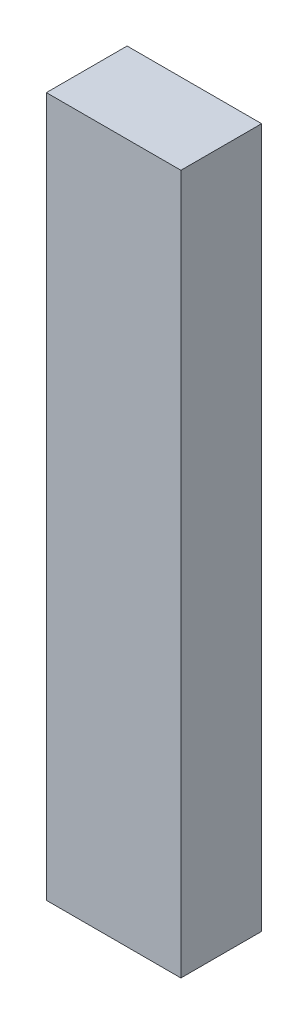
ISO-10303-21;
HEADER;
FILE_DESCRIPTION(('STEP AP214'),'2;1');
FILE_NAME('part.step','',(''),(''),'','','');
FILE_SCHEMA(('AUTOMOTIVE_DESIGN { 1 0 10303 214 1 1 1 1 }'));
ENDSEC;
DATA;
#1=APPLICATION_CONTEXT('core data for automotive mechanical design processes');
#2=APPLICATION_PROTOCOL_DEFINITION('international standard','automotive_design',2000,#1);
#3=PRODUCT_CONTEXT('',#1,'mechanical');
#4=PRODUCT('Part','Part','',(#3));
#5=PRODUCT_RELATED_PRODUCT_CATEGORY('part','',(#4));
#6=PRODUCT_DEFINITION_FORMATION('','',#4);
#7=PRODUCT_DEFINITION_CONTEXT('part definition',#1,'design');
#8=PRODUCT_DEFINITION('design','',#6,#7);
#9=PRODUCT_DEFINITION_SHAPE('','',#8);
#10=(LENGTH_UNIT() NAMED_UNIT(*) SI_UNIT(.MILLI.,.METRE.));
#11=(NAMED_UNIT(*) PLANE_ANGLE_UNIT() SI_UNIT($,.RADIAN.));
#12=(NAMED_UNIT(*) SI_UNIT($,.STERADIAN.) SOLID_ANGLE_UNIT());
#13=UNCERTAINTY_MEASURE_WITH_UNIT(LENGTH_MEASURE(1.E-05),#10,'distance_accuracy_value','');
#14=(GEOMETRIC_REPRESENTATION_CONTEXT(3) GLOBAL_UNCERTAINTY_ASSIGNED_CONTEXT((#13)) GLOBAL_UNIT_ASSIGNED_CONTEXT((#10,
#11,#12)) REPRESENTATION_CONTEXT('',''));
#15=CARTESIAN_POINT('',(0.,0.,0.));
#16=DIRECTION('',(0.,0.,1.));
#17=DIRECTION('',(1.,0.,0.));
#18=AXIS2_PLACEMENT_3D('',#15,#16,#17);
#19=CARTESIAN_POINT('',(63.5000000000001,-165.1,38.1));
#20=DIRECTION('',(0.,1.,0.));
#21=DIRECTION('',(0.,0.,1.));
#22=AXIS2_PLACEMENT_3D('',#19,#20,#21);
#23=PLANE('',#22);
#24=DIRECTION('',(0.,0.,-1.));
#25=VECTOR('',#24,1.);
#26=CARTESIAN_POINT('',(0.,-165.1,38.1));
#27=LINE('',#26,#25);
#28=CARTESIAN_POINT('',(0.,-165.1,38.1));
#29=VERTEX_POINT('',#28);
#30=CARTESIAN_POINT('',(0.,-165.1,0.));
#31=VERTEX_POINT('',#30);
#32=EDGE_CURVE('E115',#29,#31,#27,.T.);
#33=ORIENTED_EDGE('',*,*,#32,.T.);
#34=DIRECTION('',(-1.,0.,0.));
#35=VECTOR('',#34,1.);
#36=CARTESIAN_POINT('',(63.5000000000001,-165.1,0.));
#37=LINE('',#36,#35);
#38=CARTESIAN_POINT('',(63.5000000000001,-165.1,0.));
#39=VERTEX_POINT('',#38);
#40=EDGE_CURVE('E11',#39,#31,#37,.T.);
#41=ORIENTED_EDGE('',*,*,#40,.F.);
#42=DIRECTION('',(0.,0.,-1.));
#43=VECTOR('',#42,1.);
#44=CARTESIAN_POINT('',(63.5000000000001,-165.1,38.1));
#45=LINE('',#44,#43);
#46=CARTESIAN_POINT('',(63.5000000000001,-165.1,38.1));
#47=VERTEX_POINT('',#46);
#48=EDGE_CURVE('E94',#47,#39,#45,.T.);
#49=ORIENTED_EDGE('',*,*,#48,.F.);
#50=DIRECTION('',(-1.,0.,0.));
#51=VECTOR('',#50,1.);
#52=CARTESIAN_POINT('',(63.5000000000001,-165.1,38.1));
#53=LINE('',#52,#51);
#54=EDGE_CURVE('E106',#47,#29,#53,.T.);
#55=ORIENTED_EDGE('',*,*,#54,.T.);
#56=EDGE_LOOP('',(#33,#41,#49,#55));
#57=FACE_BOUND('',#56,.T.);
#58=ADVANCED_FACE('F43',(#57),#23,.F.);
#59=CARTESIAN_POINT('',(63.5000000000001,-165.1,0.));
#60=DIRECTION('',(0.,0.,1.));
#61=DIRECTION('',(1.,0.,0.));
#62=AXIS2_PLACEMENT_3D('',#59,#60,#61);
#63=PLANE('',#62);
#64=DIRECTION('',(0.,1.,0.));
#65=VECTOR('',#64,1.);
#66=CARTESIAN_POINT('',(0.,-165.1,0.));
#67=LINE('',#66,#65);
#68=CARTESIAN_POINT('',(0.,165.1,0.));
#69=VERTEX_POINT('',#68);
#70=EDGE_CURVE('E99',#31,#69,#67,.T.);
#71=ORIENTED_EDGE('',*,*,#70,.T.);
#72=DIRECTION('',(-1.,0.,0.));
#73=VECTOR('',#72,1.);
#74=CARTESIAN_POINT('',(63.5000000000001,165.1,0.));
#75=LINE('',#74,#73);
#76=CARTESIAN_POINT('',(63.5000000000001,165.1,0.));
#77=VERTEX_POINT('',#76);
#78=EDGE_CURVE('E55',#77,#69,#75,.T.);
#79=ORIENTED_EDGE('',*,*,#78,.F.);
#80=DIRECTION('',(0.,1.,0.));
#81=VECTOR('',#80,1.);
#82=CARTESIAN_POINT('',(63.5000000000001,-165.1,0.));
#83=LINE('',#82,#81);
#84=EDGE_CURVE('E89',#39,#77,#83,.T.);
#85=ORIENTED_EDGE('',*,*,#84,.F.);
#86=ORIENTED_EDGE('',*,*,#40,.T.);
#87=EDGE_LOOP('',(#71,#79,#85,#86));
#88=FACE_BOUND('',#87,.T.);
#89=ADVANCED_FACE('F98',(#88),#63,.F.);
#90=CARTESIAN_POINT('',(63.5000000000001,165.1,0.));
#91=DIRECTION('',(0.,-1.,0.));
#92=DIRECTION('',(0.,0.,-1.));
#93=AXIS2_PLACEMENT_3D('',#90,#91,#92);
#94=PLANE('',#93);
#95=DIRECTION('',(0.,0.,1.));
#96=VECTOR('',#95,1.);
#97=CARTESIAN_POINT('',(0.,165.1,0.));
#98=LINE('',#97,#96);
#99=CARTESIAN_POINT('',(0.,165.1,38.1));
#100=VERTEX_POINT('',#99);
#101=EDGE_CURVE('E77',#69,#100,#98,.T.);
#102=ORIENTED_EDGE('',*,*,#101,.T.);
#103=DIRECTION('',(-1.,0.,0.));
#104=VECTOR('',#103,1.);
#105=CARTESIAN_POINT('',(63.5000000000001,165.1,38.1));
#106=LINE('',#105,#104);
#107=CARTESIAN_POINT('',(63.5000000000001,165.1,38.1));
#108=VERTEX_POINT('',#107);
#109=EDGE_CURVE('E105',#108,#100,#106,.T.);
#110=ORIENTED_EDGE('',*,*,#109,.F.);
#111=DIRECTION('',(0.,0.,1.));
#112=VECTOR('',#111,1.);
#113=CARTESIAN_POINT('',(63.5000000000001,165.1,0.));
#114=LINE('',#113,#112);
#115=EDGE_CURVE('E93',#77,#108,#114,.T.);
#116=ORIENTED_EDGE('',*,*,#115,.F.);
#117=ORIENTED_EDGE('',*,*,#78,.T.);
#118=EDGE_LOOP('',(#102,#110,#116,#117));
#119=FACE_BOUND('',#118,.T.);
#120=ADVANCED_FACE('F104',(#119),#94,.F.);
#121=CARTESIAN_POINT('',(63.5000000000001,165.1,38.1));
#122=DIRECTION('',(0.,0.,-1.));
#123=DIRECTION('',(-1.,0.,0.));
#124=AXIS2_PLACEMENT_3D('',#121,#122,#123);
#125=PLANE('',#124);
#126=DIRECTION('',(0.,-1.,0.));
#127=VECTOR('',#126,1.);
#128=CARTESIAN_POINT('',(0.,165.1,38.1));
#129=LINE('',#128,#127);
#130=EDGE_CURVE('E81',#100,#29,#129,.T.);
#131=ORIENTED_EDGE('',*,*,#130,.T.);
#132=ORIENTED_EDGE('',*,*,#54,.F.);
#133=DIRECTION('',(0.,-1.,0.));
#134=VECTOR('',#133,1.);
#135=CARTESIAN_POINT('',(63.5000000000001,165.1,38.1));
#136=LINE('',#135,#134);
#137=EDGE_CURVE('E58',#108,#47,#136,.T.);
#138=ORIENTED_EDGE('',*,*,#137,.F.);
#139=ORIENTED_EDGE('',*,*,#109,.T.);
#140=EDGE_LOOP('',(#131,#132,#138,#139));
#141=FACE_BOUND('',#140,.T.);
#142=ADVANCED_FACE('F128',(#141),#125,.F.);
#143=CARTESIAN_POINT('',(63.5000000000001,0.,0.));
#144=DIRECTION('',(1.,0.,0.));
#145=DIRECTION('',(0.,0.,-1.));
#146=AXIS2_PLACEMENT_3D('',#143,#144,#145);
#147=PLANE('',#146);
#148=ORIENTED_EDGE('',*,*,#48,.T.);
#149=ORIENTED_EDGE('',*,*,#84,.T.);
#150=ORIENTED_EDGE('',*,*,#115,.T.);
#151=ORIENTED_EDGE('',*,*,#137,.T.);
#152=EDGE_LOOP('',(#148,#149,#150,#151));
#153=FACE_BOUND('',#152,.T.);
#154=ADVANCED_FACE('F91',(#153),#147,.T.);
#155=CARTESIAN_POINT('',(0.,0.,0.));
#156=DIRECTION('',(1.,0.,0.));
#157=DIRECTION('',(0.,0.,-1.));
#158=AXIS2_PLACEMENT_3D('',#155,#156,#157);
#159=PLANE('',#158);
#160=ORIENTED_EDGE('',*,*,#32,.F.);
#161=ORIENTED_EDGE('',*,*,#130,.F.);
#162=ORIENTED_EDGE('',*,*,#101,.F.);
#163=ORIENTED_EDGE('',*,*,#70,.F.);
#164=EDGE_LOOP('',(#160,#161,#162,#163));
#165=FACE_BOUND('',#164,.T.);
#166=ADVANCED_FACE('F129',(#165),#159,.F.);
#167=CLOSED_SHELL('',(#58,#89,#120,#142,#154,#166));
#168=MANIFOLD_SOLID_BREP('B2',#167);
#169=ADVANCED_BREP_SHAPE_REPRESENTATION('',(#18,#168),#14);
#170=SHAPE_DEFINITION_REPRESENTATION(#9,#169);
ENDSEC;
END-ISO-10303-21;
